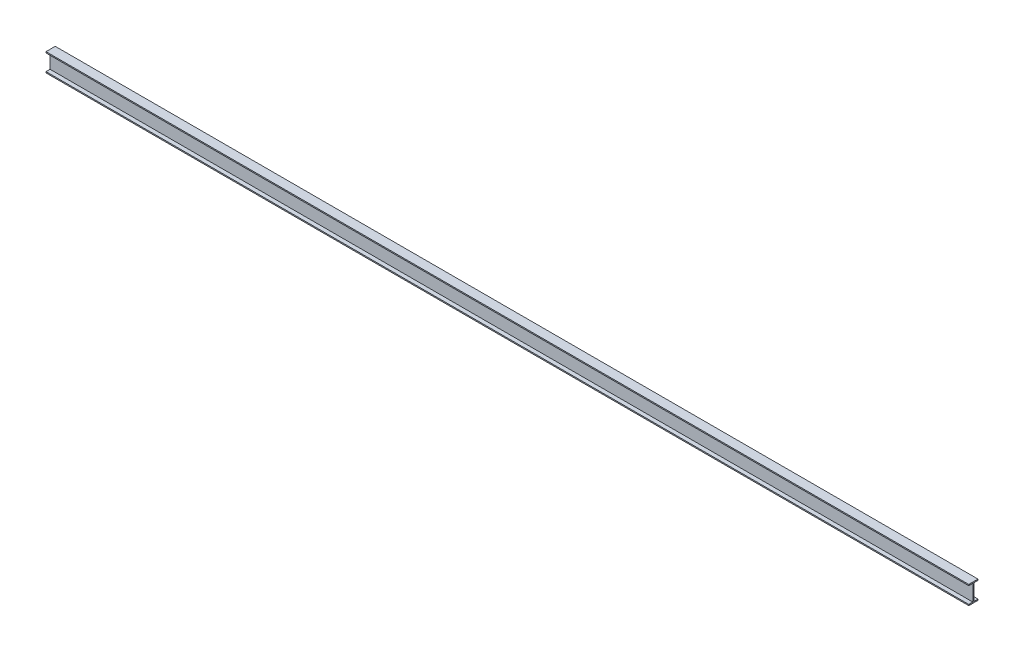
from build123d import *

# Parameters (mm, degrees)
BOSS_EXTRU_1_DEPTH = 8000


with BuildPart() as part:
    # Esquisse1 → Boss.-Extru.1 (new body)
    with BuildSketch(Plane(origin=(0, 0, 0), x_dir=(0, 0, -1), z_dir=(1, 0, 0))):
        Polygon((-40, 0), (40, 0), (40, 10), (5, 10), (5, 150), (40, 150), (40, 160), (-40, 160), (-40, 150), (-5, 150), (-5, 10), (-40, 10), align=None)
    extrude(amount=BOSS_EXTRU_1_DEPTH)


solid = part.part
